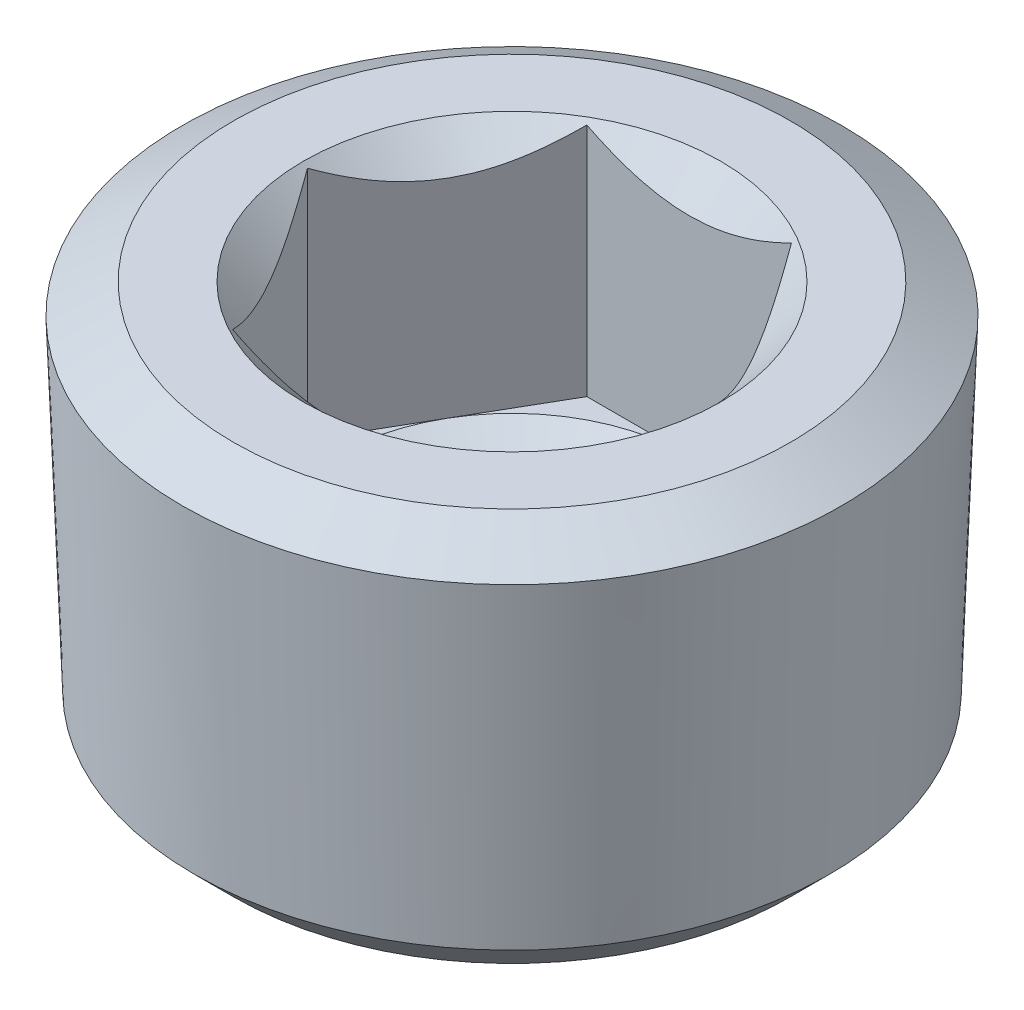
from build123d import *

# Parameters (mm, degrees)
CUT_EXTRUDE1_START = -9.652
CUT_EXTRUDE1_DEPTH = 9.487142


with BuildPart() as part:
    # Sketch2 → Revolve1 (revolve)
    with BuildSketch(Plane.XY, mode=Mode.PRIVATE) as revolve1_sk:
        Polygon((0, 0), (-11.232219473, 0), (-13.291650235, -1.189012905), (-12.813884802, -14.293334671), (-11.232219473, -15.875), (0, -15.875), align=None)
    revolve(revolve1_sk.sketch.rotate(Axis((0, 10.744282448, 0), (0, -1, 0)), 270), axis=Axis((0, 10.744282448, 0), (0, -1, 0)))

    # Sketch3 → Cut-Revolve1 (revolve, cut)
    with BuildSketch(Plane.XY, mode=Mode.PRIVATE) as cut_revolve1_sk:
        Polygon((0, 0), (-8.41375, 0), (-7.14375, -1.27), (-7.14375, -9.652), (-2.916480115, -12.192), (0, -12.192), align=None)
    revolve(cut_revolve1_sk.sketch.rotate(Axis((0, 2.934222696, 0), (0, -1, 0)), 270), axis=Axis((0, 2.934222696, 0), (0, -1, 0)), mode=Mode.SUBTRACT)

    # Sketch4 → Cut-Extrude1 (cut)
    with BuildSketch(Plane(origin=(0, 0, 0), x_dir=(1, 0, 0), z_dir=(0, 1, 0)).offset(CUT_EXTRUDE1_START)):
        Polygon((-4.124445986, -7.14375), (4.124445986, -7.14375), (8.248891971, 0), (4.124445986, 7.14375), (-4.124445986, 7.14375), (-8.248891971, 0), align=None)
    extrude(amount=CUT_EXTRUDE1_DEPTH, mode=Mode.SUBTRACT)


solid = part.part
